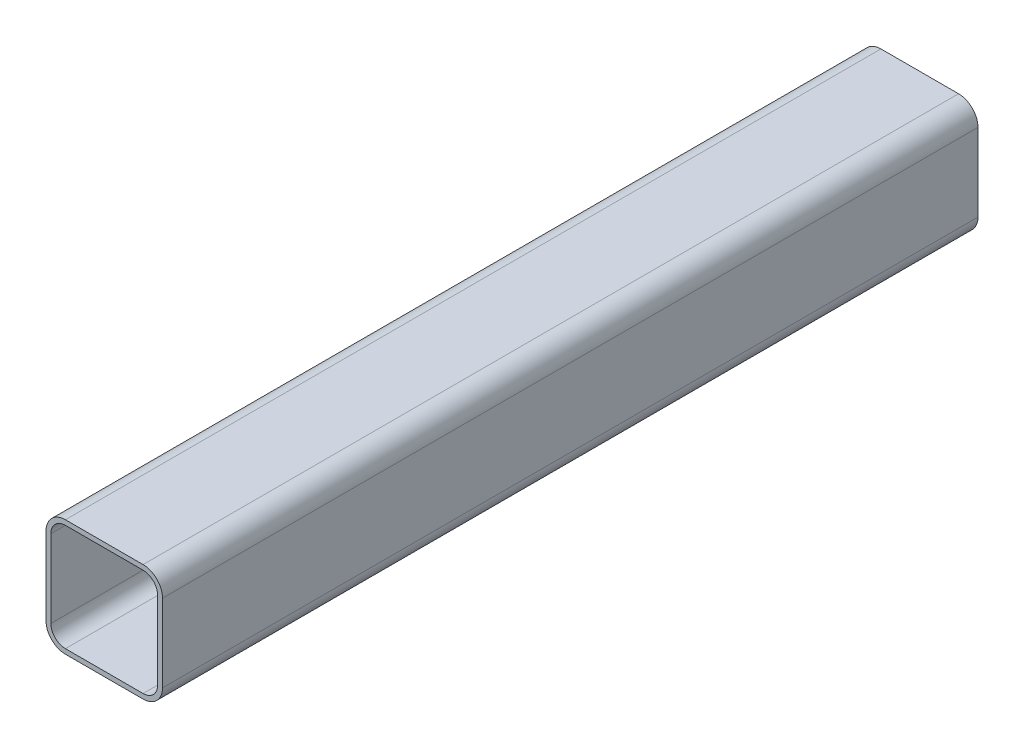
ISO-10303-21;
HEADER;
FILE_DESCRIPTION(('STEP AP214'),'2;1');
FILE_NAME('part.step','',(''),(''),'','','');
FILE_SCHEMA(('AUTOMOTIVE_DESIGN { 1 0 10303 214 1 1 1 1 }'));
ENDSEC;
DATA;
#1=APPLICATION_CONTEXT('core data for automotive mechanical design processes');
#2=APPLICATION_PROTOCOL_DEFINITION('international standard','automotive_design',2000,#1);
#3=PRODUCT_CONTEXT('',#1,'mechanical');
#4=PRODUCT('Part','Part','',(#3));
#5=PRODUCT_RELATED_PRODUCT_CATEGORY('part','',(#4));
#6=PRODUCT_DEFINITION_FORMATION('','',#4);
#7=PRODUCT_DEFINITION_CONTEXT('part definition',#1,'design');
#8=PRODUCT_DEFINITION('design','',#6,#7);
#9=PRODUCT_DEFINITION_SHAPE('','',#8);
#10=(LENGTH_UNIT() NAMED_UNIT(*) SI_UNIT(.MILLI.,.METRE.));
#11=(NAMED_UNIT(*) PLANE_ANGLE_UNIT() SI_UNIT($,.RADIAN.));
#12=(NAMED_UNIT(*) SI_UNIT($,.STERADIAN.) SOLID_ANGLE_UNIT());
#13=UNCERTAINTY_MEASURE_WITH_UNIT(LENGTH_MEASURE(1.E-05),#10,'distance_accuracy_value','');
#14=(GEOMETRIC_REPRESENTATION_CONTEXT(3) GLOBAL_UNCERTAINTY_ASSIGNED_CONTEXT((#13)) GLOBAL_UNIT_ASSIGNED_CONTEXT((#10,
#11,#12)) REPRESENTATION_CONTEXT('',''));
#15=CARTESIAN_POINT('',(0.,0.,0.));
#16=DIRECTION('',(0.,0.,1.));
#17=DIRECTION('',(1.,0.,0.));
#18=AXIS2_PLACEMENT_3D('',#15,#16,#17);
#19=CARTESIAN_POINT('',(25.4,25.4,533.4));
#20=DIRECTION('',(0.,0.,1.));
#21=DIRECTION('',(1.,0.,0.));
#22=AXIS2_PLACEMENT_3D('',#19,#20,#21);
#23=PLANE('',#22);
#24=CARTESIAN_POINT('',(25.4,25.4,533.4));
#25=DIRECTION('',(0.,0.,1.));
#26=DIRECTION('',(1.,0.,0.));
#27=AXIS2_PLACEMENT_3D('',#24,#25,#26);
#28=CIRCLE('',#27,12.7);
#29=CARTESIAN_POINT('',(38.1,25.4,533.4));
#30=VERTEX_POINT('',#29);
#31=CARTESIAN_POINT('',(25.4,38.1,533.4));
#32=VERTEX_POINT('',#31);
#33=EDGE_CURVE('E212',#30,#32,#28,.T.);
#34=ORIENTED_EDGE('',*,*,#33,.T.);
#35=DIRECTION('',(1.,0.,0.));
#36=VECTOR('',#35,1.);
#37=CARTESIAN_POINT('',(-25.4,38.1,533.4));
#38=LINE('',#37,#36);
#39=CARTESIAN_POINT('',(-25.4,38.1,533.4));
#40=VERTEX_POINT('',#39);
#41=EDGE_CURVE('E214',#40,#32,#38,.T.);
#42=ORIENTED_EDGE('',*,*,#41,.F.);
#43=CARTESIAN_POINT('',(-25.4,25.4,533.4));
#44=DIRECTION('',(0.,0.,-1.));
#45=DIRECTION('',(-1.,0.,0.));
#46=AXIS2_PLACEMENT_3D('',#43,#44,#45);
#47=CIRCLE('',#46,12.7);
#48=CARTESIAN_POINT('',(-38.1,25.4,533.4));
#49=VERTEX_POINT('',#48);
#50=EDGE_CURVE('E218',#49,#40,#47,.T.);
#51=ORIENTED_EDGE('',*,*,#50,.F.);
#52=DIRECTION('',(0.,-1.,0.));
#53=VECTOR('',#52,1.);
#54=CARTESIAN_POINT('',(-38.1,25.4,533.4));
#55=LINE('',#54,#53);
#56=CARTESIAN_POINT('',(-38.1,-25.4,533.4));
#57=VERTEX_POINT('',#56);
#58=EDGE_CURVE('E221',#49,#57,#55,.T.);
#59=ORIENTED_EDGE('',*,*,#58,.T.);
#60=CARTESIAN_POINT('',(-25.4,-25.4,533.4));
#61=DIRECTION('',(0.,0.,-1.));
#62=DIRECTION('',(-1.,0.,0.));
#63=AXIS2_PLACEMENT_3D('',#60,#61,#62);
#64=CIRCLE('',#63,12.7);
#65=CARTESIAN_POINT('',(-25.4,-38.1,533.4));
#66=VERTEX_POINT('',#65);
#67=EDGE_CURVE('E223',#66,#57,#64,.T.);
#68=ORIENTED_EDGE('',*,*,#67,.F.);
#69=DIRECTION('',(-1.,0.,0.));
#70=VECTOR('',#69,1.);
#71=CARTESIAN_POINT('',(25.4,-38.1,533.4));
#72=LINE('',#71,#70);
#73=CARTESIAN_POINT('',(25.4,-38.1,533.4));
#74=VERTEX_POINT('',#73);
#75=EDGE_CURVE('E226',#74,#66,#72,.T.);
#76=ORIENTED_EDGE('',*,*,#75,.F.);
#77=CARTESIAN_POINT('',(25.4,-25.4,533.4));
#78=DIRECTION('',(0.,0.,-1.));
#79=DIRECTION('',(-1.,0.,0.));
#80=AXIS2_PLACEMENT_3D('',#77,#78,#79);
#81=CIRCLE('',#80,12.7);
#82=CARTESIAN_POINT('',(38.1,-25.4000000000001,533.4));
#83=VERTEX_POINT('',#82);
#84=EDGE_CURVE('E229',#83,#74,#81,.T.);
#85=ORIENTED_EDGE('',*,*,#84,.F.);
#86=DIRECTION('',(0.,1.,0.));
#87=VECTOR('',#86,1.);
#88=CARTESIAN_POINT('',(38.1,-25.4000000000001,533.4));
#89=LINE('',#88,#87);
#90=EDGE_CURVE('E232',#83,#30,#89,.T.);
#91=ORIENTED_EDGE('',*,*,#90,.T.);
#92=EDGE_LOOP('',(#34,#42,#51,#59,#68,#76,#85,#91));
#93=FACE_BOUND('',#92,.T.);
#94=DIRECTION('',(1.,0.,0.));
#95=VECTOR('',#94,1.);
#96=CARTESIAN_POINT('',(-25.4,34.925,533.4));
#97=LINE('',#96,#95);
#98=CARTESIAN_POINT('',(-25.4,34.925,533.4));
#99=VERTEX_POINT('',#98);
#100=CARTESIAN_POINT('',(25.4,34.925,533.4));
#101=VERTEX_POINT('',#100);
#102=EDGE_CURVE('E152',#99,#101,#97,.T.);
#103=ORIENTED_EDGE('',*,*,#102,.T.);
#104=CARTESIAN_POINT('',(25.4,25.4,533.4));
#105=DIRECTION('',(0.,0.,1.));
#106=DIRECTION('',(1.,0.,0.));
#107=AXIS2_PLACEMENT_3D('',#104,#105,#106);
#108=CIRCLE('',#107,9.525);
#109=CARTESIAN_POINT('',(34.925,25.4,533.4));
#110=VERTEX_POINT('',#109);
#111=EDGE_CURVE('E143',#110,#101,#108,.T.);
#112=ORIENTED_EDGE('',*,*,#111,.F.);
#113=DIRECTION('',(0.,1.,0.));
#114=VECTOR('',#113,1.);
#115=CARTESIAN_POINT('',(34.925,-25.4000000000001,533.4));
#116=LINE('',#115,#114);
#117=CARTESIAN_POINT('',(34.925,-25.4000000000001,533.4));
#118=VERTEX_POINT('',#117);
#119=EDGE_CURVE('E179',#118,#110,#116,.T.);
#120=ORIENTED_EDGE('',*,*,#119,.F.);
#121=CARTESIAN_POINT('',(25.4,-25.4,533.4));
#122=DIRECTION('',(0.,0.,1.));
#123=DIRECTION('',(1.,0.,0.));
#124=AXIS2_PLACEMENT_3D('',#121,#122,#123);
#125=CIRCLE('',#124,9.525);
#126=CARTESIAN_POINT('',(25.4,-34.925,533.4));
#127=VERTEX_POINT('',#126);
#128=EDGE_CURVE('E47',#118,#127,#125,.F.);
#129=ORIENTED_EDGE('',*,*,#128,.T.);
#130=DIRECTION('',(-1.,0.,0.));
#131=VECTOR('',#130,1.);
#132=CARTESIAN_POINT('',(25.4,-34.925,533.4));
#133=LINE('',#132,#131);
#134=CARTESIAN_POINT('',(-25.4,-34.925,533.4));
#135=VERTEX_POINT('',#134);
#136=EDGE_CURVE('E175',#127,#135,#133,.T.);
#137=ORIENTED_EDGE('',*,*,#136,.T.);
#138=CARTESIAN_POINT('',(-25.4,-25.4,533.4));
#139=DIRECTION('',(0.,0.,1.));
#140=DIRECTION('',(1.,0.,0.));
#141=AXIS2_PLACEMENT_3D('',#138,#139,#140);
#142=CIRCLE('',#141,9.52499999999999);
#143=CARTESIAN_POINT('',(-34.925,-25.4,533.4));
#144=VERTEX_POINT('',#143);
#145=EDGE_CURVE('E172',#135,#144,#142,.F.);
#146=ORIENTED_EDGE('',*,*,#145,.T.);
#147=DIRECTION('',(0.,-1.,0.));
#148=VECTOR('',#147,1.);
#149=CARTESIAN_POINT('',(-34.925,25.4,533.4));
#150=LINE('',#149,#148);
#151=CARTESIAN_POINT('',(-34.925,25.4,533.4));
#152=VERTEX_POINT('',#151);
#153=EDGE_CURVE('E168',#152,#144,#150,.T.);
#154=ORIENTED_EDGE('',*,*,#153,.F.);
#155=CARTESIAN_POINT('',(-25.4,25.4,533.4));
#156=DIRECTION('',(0.,0.,1.));
#157=DIRECTION('',(1.,0.,0.));
#158=AXIS2_PLACEMENT_3D('',#155,#156,#157);
#159=CIRCLE('',#158,9.525);
#160=EDGE_CURVE('E166',#152,#99,#159,.F.);
#161=ORIENTED_EDGE('',*,*,#160,.T.);
#162=EDGE_LOOP('',(#103,#112,#120,#129,#137,#146,#154,#161));
#163=FACE_BOUND('',#162,.T.);
#164=ADVANCED_FACE('F32',(#93,#163),#23,.T.);
#165=CARTESIAN_POINT('',(25.4,25.4,0.));
#166=DIRECTION('',(0.,0.,1.));
#167=DIRECTION('',(1.,0.,0.));
#168=AXIS2_PLACEMENT_3D('',#165,#166,#167);
#169=PLANE('',#168);
#170=CARTESIAN_POINT('',(25.4,25.4,0.));
#171=DIRECTION('',(0.,0.,1.));
#172=DIRECTION('',(1.,0.,0.));
#173=AXIS2_PLACEMENT_3D('',#170,#171,#172);
#174=CIRCLE('',#173,12.7);
#175=CARTESIAN_POINT('',(38.1,25.4,0.));
#176=VERTEX_POINT('',#175);
#177=CARTESIAN_POINT('',(25.4,38.1,0.));
#178=VERTEX_POINT('',#177);
#179=EDGE_CURVE('E161',#176,#178,#174,.T.);
#180=ORIENTED_EDGE('',*,*,#179,.F.);
#181=DIRECTION('',(0.,1.,0.));
#182=VECTOR('',#181,1.);
#183=CARTESIAN_POINT('',(38.1,-25.4000000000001,0.));
#184=LINE('',#183,#182);
#185=CARTESIAN_POINT('',(38.1,-25.4000000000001,0.));
#186=VERTEX_POINT('',#185);
#187=EDGE_CURVE('E215',#186,#176,#184,.T.);
#188=ORIENTED_EDGE('',*,*,#187,.F.);
#189=CARTESIAN_POINT('',(25.4,-25.4,0.));
#190=DIRECTION('',(0.,0.,-1.));
#191=DIRECTION('',(-1.,0.,0.));
#192=AXIS2_PLACEMENT_3D('',#189,#190,#191);
#193=CIRCLE('',#192,12.7);
#194=CARTESIAN_POINT('',(25.4,-38.1,0.));
#195=VERTEX_POINT('',#194);
#196=EDGE_CURVE('E252',#186,#195,#193,.T.);
#197=ORIENTED_EDGE('',*,*,#196,.T.);
#198=DIRECTION('',(-1.,0.,0.));
#199=VECTOR('',#198,1.);
#200=CARTESIAN_POINT('',(25.4,-38.1,0.));
#201=LINE('',#200,#199);
#202=CARTESIAN_POINT('',(-25.4,-38.1,0.));
#203=VERTEX_POINT('',#202);
#204=EDGE_CURVE('E249',#195,#203,#201,.T.);
#205=ORIENTED_EDGE('',*,*,#204,.T.);
#206=CARTESIAN_POINT('',(-25.4,-25.4,0.));
#207=DIRECTION('',(0.,0.,-1.));
#208=DIRECTION('',(-1.,0.,0.));
#209=AXIS2_PLACEMENT_3D('',#206,#207,#208);
#210=CIRCLE('',#209,12.7);
#211=CARTESIAN_POINT('',(-38.1,-25.4,0.));
#212=VERTEX_POINT('',#211);
#213=EDGE_CURVE('E246',#203,#212,#210,.T.);
#214=ORIENTED_EDGE('',*,*,#213,.T.);
#215=DIRECTION('',(0.,-1.,0.));
#216=VECTOR('',#215,1.);
#217=CARTESIAN_POINT('',(-38.1,25.4,0.));
#218=LINE('',#217,#216);
#219=CARTESIAN_POINT('',(-38.1,25.4,0.));
#220=VERTEX_POINT('',#219);
#221=EDGE_CURVE('E243',#220,#212,#218,.T.);
#222=ORIENTED_EDGE('',*,*,#221,.F.);
#223=CARTESIAN_POINT('',(-25.4,25.4,0.));
#224=DIRECTION('',(0.,0.,-1.));
#225=DIRECTION('',(-1.,0.,0.));
#226=AXIS2_PLACEMENT_3D('',#223,#224,#225);
#227=CIRCLE('',#226,12.7);
#228=CARTESIAN_POINT('',(-25.4,38.1,0.));
#229=VERTEX_POINT('',#228);
#230=EDGE_CURVE('E240',#220,#229,#227,.T.);
#231=ORIENTED_EDGE('',*,*,#230,.T.);
#232=DIRECTION('',(1.,0.,0.));
#233=VECTOR('',#232,1.);
#234=CARTESIAN_POINT('',(-25.4,38.1,0.));
#235=LINE('',#234,#233);
#236=EDGE_CURVE('E237',#229,#178,#235,.T.);
#237=ORIENTED_EDGE('',*,*,#236,.T.);
#238=EDGE_LOOP('',(#180,#188,#197,#205,#214,#222,#231,#237));
#239=FACE_BOUND('',#238,.T.);
#240=CARTESIAN_POINT('',(25.4,25.4,0.));
#241=DIRECTION('',(0.,0.,1.));
#242=DIRECTION('',(1.,0.,0.));
#243=AXIS2_PLACEMENT_3D('',#240,#241,#242);
#244=CIRCLE('',#243,9.525);
#245=CARTESIAN_POINT('',(34.925,25.4,0.));
#246=VERTEX_POINT('',#245);
#247=CARTESIAN_POINT('',(25.4,34.925,0.));
#248=VERTEX_POINT('',#247);
#249=EDGE_CURVE('E55',#246,#248,#244,.T.);
#250=ORIENTED_EDGE('',*,*,#249,.T.);
#251=DIRECTION('',(1.,0.,0.));
#252=VECTOR('',#251,1.);
#253=CARTESIAN_POINT('',(-25.4,34.925,0.));
#254=LINE('',#253,#252);
#255=CARTESIAN_POINT('',(-25.4,34.925,0.));
#256=VERTEX_POINT('',#255);
#257=EDGE_CURVE('E160',#256,#248,#254,.T.);
#258=ORIENTED_EDGE('',*,*,#257,.F.);
#259=CARTESIAN_POINT('',(-25.4,25.4,0.));
#260=DIRECTION('',(0.,0.,1.));
#261=DIRECTION('',(1.,0.,0.));
#262=AXIS2_PLACEMENT_3D('',#259,#260,#261);
#263=CIRCLE('',#262,9.525);
#264=CARTESIAN_POINT('',(-34.925,25.4,0.));
#265=VERTEX_POINT('',#264);
#266=EDGE_CURVE('E183',#265,#256,#263,.F.);
#267=ORIENTED_EDGE('',*,*,#266,.F.);
#268=DIRECTION('',(0.,-1.,0.));
#269=VECTOR('',#268,1.);
#270=CARTESIAN_POINT('',(-34.925,25.4,0.));
#271=LINE('',#270,#269);
#272=CARTESIAN_POINT('',(-34.925,-25.4,0.));
#273=VERTEX_POINT('',#272);
#274=EDGE_CURVE('E186',#265,#273,#271,.T.);
#275=ORIENTED_EDGE('',*,*,#274,.T.);
#276=CARTESIAN_POINT('',(-25.4,-25.4,0.));
#277=DIRECTION('',(0.,0.,1.));
#278=DIRECTION('',(1.,0.,0.));
#279=AXIS2_PLACEMENT_3D('',#276,#277,#278);
#280=CIRCLE('',#279,9.52499999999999);
#281=CARTESIAN_POINT('',(-25.4,-34.925,0.));
#282=VERTEX_POINT('',#281);
#283=EDGE_CURVE('E189',#282,#273,#280,.F.);
#284=ORIENTED_EDGE('',*,*,#283,.F.);
#285=DIRECTION('',(-1.,0.,0.));
#286=VECTOR('',#285,1.);
#287=CARTESIAN_POINT('',(25.4,-34.925,0.));
#288=LINE('',#287,#286);
#289=CARTESIAN_POINT('',(25.4,-34.925,0.));
#290=VERTEX_POINT('',#289);
#291=EDGE_CURVE('E192',#290,#282,#288,.T.);
#292=ORIENTED_EDGE('',*,*,#291,.F.);
#293=CARTESIAN_POINT('',(25.4,-25.4,0.));
#294=DIRECTION('',(0.,0.,1.));
#295=DIRECTION('',(1.,0.,0.));
#296=AXIS2_PLACEMENT_3D('',#293,#294,#295);
#297=CIRCLE('',#296,9.525);
#298=CARTESIAN_POINT('',(34.925,-25.4000000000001,0.));
#299=VERTEX_POINT('',#298);
#300=EDGE_CURVE('E195',#299,#290,#297,.F.);
#301=ORIENTED_EDGE('',*,*,#300,.F.);
#302=DIRECTION('',(0.,1.,0.));
#303=VECTOR('',#302,1.);
#304=CARTESIAN_POINT('',(34.925,-25.4000000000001,0.));
#305=LINE('',#304,#303);
#306=EDGE_CURVE('E153',#299,#246,#305,.T.);
#307=ORIENTED_EDGE('',*,*,#306,.T.);
#308=EDGE_LOOP('',(#250,#258,#267,#275,#284,#292,#301,#307));
#309=FACE_BOUND('',#308,.T.);
#310=ADVANCED_FACE('F279',(#239,#309),#169,.F.);
#311=CARTESIAN_POINT('',(25.4,25.4,533.4));
#312=DIRECTION('',(0.,0.,-1.));
#313=DIRECTION('',(-1.,0.,0.));
#314=AXIS2_PLACEMENT_3D('',#311,#312,#313);
#315=CYLINDRICAL_SURFACE('',#314,12.7);
#316=ORIENTED_EDGE('',*,*,#179,.T.);
#317=DIRECTION('',(0.,0.,-1.));
#318=VECTOR('',#317,1.);
#319=CARTESIAN_POINT('',(25.4,38.1,533.4));
#320=LINE('',#319,#318);
#321=EDGE_CURVE('E11',#32,#178,#320,.T.);
#322=ORIENTED_EDGE('',*,*,#321,.F.);
#323=ORIENTED_EDGE('',*,*,#33,.F.);
#324=DIRECTION('',(0.,0.,-1.));
#325=VECTOR('',#324,1.);
#326=CARTESIAN_POINT('',(38.1,25.4,533.4));
#327=LINE('',#326,#325);
#328=EDGE_CURVE('E234',#30,#176,#327,.T.);
#329=ORIENTED_EDGE('',*,*,#328,.T.);
#330=EDGE_LOOP('',(#316,#322,#323,#329));
#331=FACE_BOUND('',#330,.T.);
#332=ADVANCED_FACE('F34',(#331),#315,.T.);
#333=CARTESIAN_POINT('',(-25.4,38.1,533.4));
#334=DIRECTION('',(0.,1.,0.));
#335=DIRECTION('',(-1.,0.,0.));
#336=AXIS2_PLACEMENT_3D('',#333,#334,#335);
#337=PLANE('',#336);
#338=ORIENTED_EDGE('',*,*,#236,.F.);
#339=DIRECTION('',(0.,0.,-1.));
#340=VECTOR('',#339,1.);
#341=CARTESIAN_POINT('',(-25.4,38.1,533.4));
#342=LINE('',#341,#340);
#343=EDGE_CURVE('E40',#40,#229,#342,.T.);
#344=ORIENTED_EDGE('',*,*,#343,.F.);
#345=ORIENTED_EDGE('',*,*,#41,.T.);
#346=ORIENTED_EDGE('',*,*,#321,.T.);
#347=EDGE_LOOP('',(#338,#344,#345,#346));
#348=FACE_BOUND('',#347,.T.);
#349=ADVANCED_FACE('F274',(#348),#337,.T.);
#350=CARTESIAN_POINT('',(-25.4,25.4,533.4));
#351=DIRECTION('',(0.,0.,-1.));
#352=DIRECTION('',(-1.,0.,0.));
#353=AXIS2_PLACEMENT_3D('',#350,#351,#352);
#354=CYLINDRICAL_SURFACE('',#353,12.7);
#355=ORIENTED_EDGE('',*,*,#230,.F.);
#356=DIRECTION('',(0.,0.,-1.));
#357=VECTOR('',#356,1.);
#358=CARTESIAN_POINT('',(-38.1,25.4,533.4));
#359=LINE('',#358,#357);
#360=EDGE_CURVE('E266',#49,#220,#359,.T.);
#361=ORIENTED_EDGE('',*,*,#360,.F.);
#362=ORIENTED_EDGE('',*,*,#50,.T.);
#363=ORIENTED_EDGE('',*,*,#343,.T.);
#364=EDGE_LOOP('',(#355,#361,#362,#363));
#365=FACE_BOUND('',#364,.T.);
#366=ADVANCED_FACE('F270',(#365),#354,.T.);
#367=CARTESIAN_POINT('',(-38.1,25.4,533.4));
#368=DIRECTION('',(1.,0.,0.));
#369=DIRECTION('',(0.,1.,0.));
#370=AXIS2_PLACEMENT_3D('',#367,#368,#369);
#371=PLANE('',#370);
#372=ORIENTED_EDGE('',*,*,#221,.T.);
#373=DIRECTION('',(0.,0.,-1.));
#374=VECTOR('',#373,1.);
#375=CARTESIAN_POINT('',(-38.1,-25.4,533.4));
#376=LINE('',#375,#374);
#377=EDGE_CURVE('E264',#57,#212,#376,.T.);
#378=ORIENTED_EDGE('',*,*,#377,.F.);
#379=ORIENTED_EDGE('',*,*,#58,.F.);
#380=ORIENTED_EDGE('',*,*,#360,.T.);
#381=EDGE_LOOP('',(#372,#378,#379,#380));
#382=FACE_BOUND('',#381,.T.);
#383=ADVANCED_FACE('F284',(#382),#371,.F.);
#384=CARTESIAN_POINT('',(-25.4,-25.4,533.4));
#385=DIRECTION('',(0.,0.,-1.));
#386=DIRECTION('',(-1.,0.,0.));
#387=AXIS2_PLACEMENT_3D('',#384,#385,#386);
#388=CYLINDRICAL_SURFACE('',#387,12.7);
#389=ORIENTED_EDGE('',*,*,#213,.F.);
#390=DIRECTION('',(0.,0.,-1.));
#391=VECTOR('',#390,1.);
#392=CARTESIAN_POINT('',(-25.4,-38.1,533.4));
#393=LINE('',#392,#391);
#394=EDGE_CURVE('E262',#66,#203,#393,.T.);
#395=ORIENTED_EDGE('',*,*,#394,.F.);
#396=ORIENTED_EDGE('',*,*,#67,.T.);
#397=ORIENTED_EDGE('',*,*,#377,.T.);
#398=EDGE_LOOP('',(#389,#395,#396,#397));
#399=FACE_BOUND('',#398,.T.);
#400=ADVANCED_FACE('F303',(#399),#388,.T.);
#401=CARTESIAN_POINT('',(25.4,-38.1,533.4));
#402=DIRECTION('',(0.,-1.,0.));
#403=DIRECTION('',(1.,0.,0.));
#404=AXIS2_PLACEMENT_3D('',#401,#402,#403);
#405=PLANE('',#404);
#406=ORIENTED_EDGE('',*,*,#204,.F.);
#407=DIRECTION('',(0.,0.,-1.));
#408=VECTOR('',#407,1.);
#409=CARTESIAN_POINT('',(25.4,-38.1,533.4));
#410=LINE('',#409,#408);
#411=EDGE_CURVE('E260',#74,#195,#410,.T.);
#412=ORIENTED_EDGE('',*,*,#411,.F.);
#413=ORIENTED_EDGE('',*,*,#75,.T.);
#414=ORIENTED_EDGE('',*,*,#394,.T.);
#415=EDGE_LOOP('',(#406,#412,#413,#414));
#416=FACE_BOUND('',#415,.T.);
#417=ADVANCED_FACE('F301',(#416),#405,.T.);
#418=CARTESIAN_POINT('',(25.4,-25.4,533.4));
#419=DIRECTION('',(0.,0.,-1.));
#420=DIRECTION('',(-1.,0.,0.));
#421=AXIS2_PLACEMENT_3D('',#418,#419,#420);
#422=CYLINDRICAL_SURFACE('',#421,12.7);
#423=ORIENTED_EDGE('',*,*,#196,.F.);
#424=DIRECTION('',(0.,0.,-1.));
#425=VECTOR('',#424,1.);
#426=CARTESIAN_POINT('',(38.1,-25.4000000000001,533.4));
#427=LINE('',#426,#425);
#428=EDGE_CURVE('E258',#83,#186,#427,.T.);
#429=ORIENTED_EDGE('',*,*,#428,.F.);
#430=ORIENTED_EDGE('',*,*,#84,.T.);
#431=ORIENTED_EDGE('',*,*,#411,.T.);
#432=EDGE_LOOP('',(#423,#429,#430,#431));
#433=FACE_BOUND('',#432,.T.);
#434=ADVANCED_FACE('F297',(#433),#422,.T.);
#435=CARTESIAN_POINT('',(38.1,-25.4000000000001,533.4));
#436=DIRECTION('',(-1.,0.,0.));
#437=DIRECTION('',(0.,-1.,0.));
#438=AXIS2_PLACEMENT_3D('',#435,#436,#437);
#439=PLANE('',#438);
#440=ORIENTED_EDGE('',*,*,#187,.T.);
#441=ORIENTED_EDGE('',*,*,#328,.F.);
#442=ORIENTED_EDGE('',*,*,#90,.F.);
#443=ORIENTED_EDGE('',*,*,#428,.T.);
#444=EDGE_LOOP('',(#440,#441,#442,#443));
#445=FACE_BOUND('',#444,.T.);
#446=ADVANCED_FACE('F321',(#445),#439,.F.);
#447=CARTESIAN_POINT('',(25.4,25.4,533.4));
#448=DIRECTION('',(0.,0.,-1.));
#449=DIRECTION('',(-1.,0.,0.));
#450=AXIS2_PLACEMENT_3D('',#447,#448,#449);
#451=CYLINDRICAL_SURFACE('',#450,9.525);
#452=ORIENTED_EDGE('',*,*,#249,.F.);
#453=DIRECTION('',(0.,0.,-1.));
#454=VECTOR('',#453,1.);
#455=CARTESIAN_POINT('',(34.925,25.4,533.4));
#456=LINE('',#455,#454);
#457=EDGE_CURVE('E148',#110,#246,#456,.T.);
#458=ORIENTED_EDGE('',*,*,#457,.F.);
#459=ORIENTED_EDGE('',*,*,#111,.T.);
#460=DIRECTION('',(0.,0.,-1.));
#461=VECTOR('',#460,1.);
#462=CARTESIAN_POINT('',(25.4,34.925,533.4));
#463=LINE('',#462,#461);
#464=EDGE_CURVE('E146',#101,#248,#463,.T.);
#465=ORIENTED_EDGE('',*,*,#464,.T.);
#466=EDGE_LOOP('',(#452,#458,#459,#465));
#467=FACE_BOUND('',#466,.T.);
#468=ADVANCED_FACE('F145',(#467),#451,.F.);
#469=CARTESIAN_POINT('',(-25.4,34.925,533.4));
#470=DIRECTION('',(0.,1.,0.));
#471=DIRECTION('',(-1.,0.,0.));
#472=AXIS2_PLACEMENT_3D('',#469,#470,#471);
#473=PLANE('',#472);
#474=ORIENTED_EDGE('',*,*,#257,.T.);
#475=ORIENTED_EDGE('',*,*,#464,.F.);
#476=ORIENTED_EDGE('',*,*,#102,.F.);
#477=DIRECTION('',(0.,0.,-1.));
#478=VECTOR('',#477,1.);
#479=CARTESIAN_POINT('',(-25.4,34.925,533.4));
#480=LINE('',#479,#478);
#481=EDGE_CURVE('E162',#99,#256,#480,.T.);
#482=ORIENTED_EDGE('',*,*,#481,.T.);
#483=EDGE_LOOP('',(#474,#475,#476,#482));
#484=FACE_BOUND('',#483,.T.);
#485=ADVANCED_FACE('F157',(#484),#473,.F.);
#486=CARTESIAN_POINT('',(-25.4,25.4,533.4));
#487=DIRECTION('',(0.,0.,-1.));
#488=DIRECTION('',(-1.,0.,0.));
#489=AXIS2_PLACEMENT_3D('',#486,#487,#488);
#490=CYLINDRICAL_SURFACE('',#489,9.525);
#491=ORIENTED_EDGE('',*,*,#266,.T.);
#492=ORIENTED_EDGE('',*,*,#481,.F.);
#493=ORIENTED_EDGE('',*,*,#160,.F.);
#494=DIRECTION('',(0.,0.,-1.));
#495=VECTOR('',#494,1.);
#496=CARTESIAN_POINT('',(-34.925,25.4,533.4));
#497=LINE('',#496,#495);
#498=EDGE_CURVE('E209',#152,#265,#497,.T.);
#499=ORIENTED_EDGE('',*,*,#498,.T.);
#500=EDGE_LOOP('',(#491,#492,#493,#499));
#501=FACE_BOUND('',#500,.T.);
#502=ADVANCED_FACE('F344',(#501),#490,.F.);
#503=CARTESIAN_POINT('',(-34.925,25.4,533.4));
#504=DIRECTION('',(1.,0.,0.));
#505=DIRECTION('',(0.,1.,0.));
#506=AXIS2_PLACEMENT_3D('',#503,#504,#505);
#507=PLANE('',#506);
#508=ORIENTED_EDGE('',*,*,#274,.F.);
#509=ORIENTED_EDGE('',*,*,#498,.F.);
#510=ORIENTED_EDGE('',*,*,#153,.T.);
#511=DIRECTION('',(0.,0.,-1.));
#512=VECTOR('',#511,1.);
#513=CARTESIAN_POINT('',(-34.925,-25.4,533.4));
#514=LINE('',#513,#512);
#515=EDGE_CURVE('E207',#144,#273,#514,.T.);
#516=ORIENTED_EDGE('',*,*,#515,.T.);
#517=EDGE_LOOP('',(#508,#509,#510,#516));
#518=FACE_BOUND('',#517,.T.);
#519=ADVANCED_FACE('F350',(#518),#507,.T.);
#520=CARTESIAN_POINT('',(-25.4,-25.4,533.4));
#521=DIRECTION('',(0.,0.,-1.));
#522=DIRECTION('',(-1.,0.,0.));
#523=AXIS2_PLACEMENT_3D('',#520,#521,#522);
#524=CYLINDRICAL_SURFACE('',#523,9.52499999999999);
#525=ORIENTED_EDGE('',*,*,#283,.T.);
#526=ORIENTED_EDGE('',*,*,#515,.F.);
#527=ORIENTED_EDGE('',*,*,#145,.F.);
#528=DIRECTION('',(0.,0.,-1.));
#529=VECTOR('',#528,1.);
#530=CARTESIAN_POINT('',(-25.4,-34.925,533.4));
#531=LINE('',#530,#529);
#532=EDGE_CURVE('E205',#135,#282,#531,.T.);
#533=ORIENTED_EDGE('',*,*,#532,.T.);
#534=EDGE_LOOP('',(#525,#526,#527,#533));
#535=FACE_BOUND('',#534,.T.);
#536=ADVANCED_FACE('F358',(#535),#524,.F.);
#537=CARTESIAN_POINT('',(25.4,-34.925,533.4));
#538=DIRECTION('',(0.,-1.,0.));
#539=DIRECTION('',(1.,0.,0.));
#540=AXIS2_PLACEMENT_3D('',#537,#538,#539);
#541=PLANE('',#540);
#542=ORIENTED_EDGE('',*,*,#291,.T.);
#543=ORIENTED_EDGE('',*,*,#532,.F.);
#544=ORIENTED_EDGE('',*,*,#136,.F.);
#545=DIRECTION('',(0.,0.,-1.));
#546=VECTOR('',#545,1.);
#547=CARTESIAN_POINT('',(25.4,-34.925,533.4));
#548=LINE('',#547,#546);
#549=EDGE_CURVE('E203',#127,#290,#548,.T.);
#550=ORIENTED_EDGE('',*,*,#549,.T.);
#551=EDGE_LOOP('',(#542,#543,#544,#550));
#552=FACE_BOUND('',#551,.T.);
#553=ADVANCED_FACE('F366',(#552),#541,.F.);
#554=CARTESIAN_POINT('',(25.4,-25.4,533.4));
#555=DIRECTION('',(0.,0.,-1.));
#556=DIRECTION('',(-1.,0.,0.));
#557=AXIS2_PLACEMENT_3D('',#554,#555,#556);
#558=CYLINDRICAL_SURFACE('',#557,9.525);
#559=ORIENTED_EDGE('',*,*,#300,.T.);
#560=ORIENTED_EDGE('',*,*,#549,.F.);
#561=ORIENTED_EDGE('',*,*,#128,.F.);
#562=DIRECTION('',(0.,0.,-1.));
#563=VECTOR('',#562,1.);
#564=CARTESIAN_POINT('',(34.925,-25.4000000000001,533.4));
#565=LINE('',#564,#563);
#566=EDGE_CURVE('E201',#118,#299,#565,.T.);
#567=ORIENTED_EDGE('',*,*,#566,.T.);
#568=EDGE_LOOP('',(#559,#560,#561,#567));
#569=FACE_BOUND('',#568,.T.);
#570=ADVANCED_FACE('F374',(#569),#558,.F.);
#571=CARTESIAN_POINT('',(34.925,-25.4000000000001,533.4));
#572=DIRECTION('',(-1.,0.,0.));
#573=DIRECTION('',(0.,-1.,0.));
#574=AXIS2_PLACEMENT_3D('',#571,#572,#573);
#575=PLANE('',#574);
#576=ORIENTED_EDGE('',*,*,#306,.F.);
#577=ORIENTED_EDGE('',*,*,#566,.F.);
#578=ORIENTED_EDGE('',*,*,#119,.T.);
#579=ORIENTED_EDGE('',*,*,#457,.T.);
#580=EDGE_LOOP('',(#576,#577,#578,#579));
#581=FACE_BOUND('',#580,.T.);
#582=ADVANCED_FACE('F382',(#581),#575,.T.);
#583=CLOSED_SHELL('',(#164,#310,#332,#349,#366,#383,#400,#417,#434,#446,#468,#485,#502,#519,
#536,#553,#570,#582));
#584=MANIFOLD_SOLID_BREP('B2',#583);
#585=ADVANCED_BREP_SHAPE_REPRESENTATION('',(#18,#584),#14);
#586=SHAPE_DEFINITION_REPRESENTATION(#9,#585);
ENDSEC;
END-ISO-10303-21;
